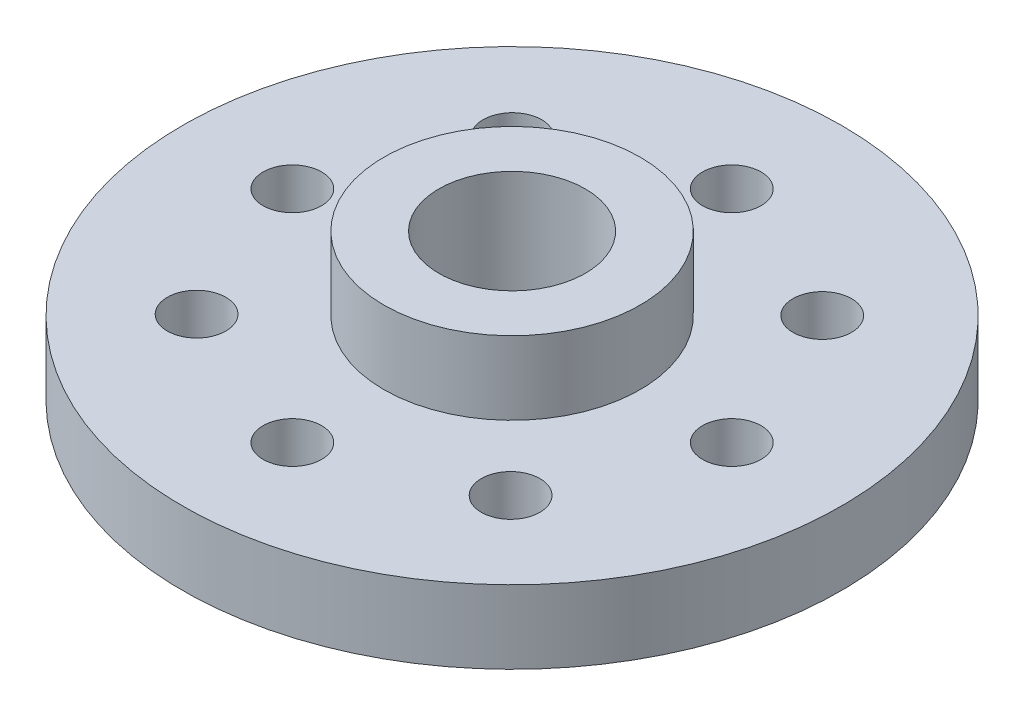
ISO-10303-21;
HEADER;
FILE_DESCRIPTION(('STEP AP214'),'2;1');
FILE_NAME('part.step','',(''),(''),'','','');
FILE_SCHEMA(('AUTOMOTIVE_DESIGN { 1 0 10303 214 1 1 1 1 }'));
ENDSEC;
DATA;
#1=APPLICATION_CONTEXT('core data for automotive mechanical design processes');
#2=APPLICATION_PROTOCOL_DEFINITION('international standard','automotive_design',2000,#1);
#3=PRODUCT_CONTEXT('',#1,'mechanical');
#4=PRODUCT('Part','Part','',(#3));
#5=PRODUCT_RELATED_PRODUCT_CATEGORY('part','',(#4));
#6=PRODUCT_DEFINITION_FORMATION('','',#4);
#7=PRODUCT_DEFINITION_CONTEXT('part definition',#1,'design');
#8=PRODUCT_DEFINITION('design','',#6,#7);
#9=PRODUCT_DEFINITION_SHAPE('','',#8);
#10=(LENGTH_UNIT() NAMED_UNIT(*) SI_UNIT(.MILLI.,.METRE.));
#11=(NAMED_UNIT(*) PLANE_ANGLE_UNIT() SI_UNIT($,.RADIAN.));
#12=(NAMED_UNIT(*) SI_UNIT($,.STERADIAN.) SOLID_ANGLE_UNIT());
#13=UNCERTAINTY_MEASURE_WITH_UNIT(LENGTH_MEASURE(1.E-05),#10,'distance_accuracy_value','');
#14=(GEOMETRIC_REPRESENTATION_CONTEXT(3) GLOBAL_UNCERTAINTY_ASSIGNED_CONTEXT((#13)) GLOBAL_UNIT_ASSIGNED_CONTEXT((#10,
#11,#12)) REPRESENTATION_CONTEXT('',''));
#15=CARTESIAN_POINT('',(0.,0.,0.));
#16=DIRECTION('',(0.,0.,1.));
#17=DIRECTION('',(1.,0.,0.));
#18=AXIS2_PLACEMENT_3D('',#15,#16,#17);
#19=CARTESIAN_POINT('',(0.,0.,0.));
#20=DIRECTION('',(0.,-1.,0.));
#21=DIRECTION('',(0.,0.,-1.));
#22=AXIS2_PLACEMENT_3D('',#19,#20,#21);
#23=CYLINDRICAL_SURFACE('',#22,1.);
#24=CARTESIAN_POINT('',(0.,0.5,0.));
#25=DIRECTION('',(0.,-1.,0.));
#26=DIRECTION('',(0.,0.,-1.));
#27=AXIS2_PLACEMENT_3D('',#24,#25,#26);
#28=CIRCLE('',#27,1.);
#29=CARTESIAN_POINT('',(0.,0.5,-1.));
#30=VERTEX_POINT('',#29);
#31=EDGE_CURVE('E198',#30,#30,#28,.T.);
#32=ORIENTED_EDGE('',*,*,#31,.F.);
#33=EDGE_LOOP('',(#32));
#34=FACE_BOUND('',#33,.T.);
#35=CARTESIAN_POINT('',(0.,0.,0.));
#36=DIRECTION('',(0.,-1.,0.));
#37=DIRECTION('',(0.,0.,-1.));
#38=AXIS2_PLACEMENT_3D('',#35,#36,#37);
#39=CIRCLE('',#38,1.);
#40=CARTESIAN_POINT('',(0.,0.,-1.));
#41=VERTEX_POINT('',#40);
#42=EDGE_CURVE('E11',#41,#41,#39,.T.);
#43=ORIENTED_EDGE('',*,*,#42,.T.);
#44=EDGE_LOOP('',(#43));
#45=FACE_BOUND('',#44,.T.);
#46=ADVANCED_FACE('F108',(#34,#45),#23,.F.);
#47=CARTESIAN_POINT('',(-1.,0.,0.));
#48=DIRECTION('',(0.,1.,0.));
#49=DIRECTION('',(0.,0.,1.));
#50=AXIS2_PLACEMENT_3D('',#47,#48,#49);
#51=PLANE('',#50);
#52=CARTESIAN_POINT('',(0.,0.,6.));
#53=DIRECTION('',(0.,-1.,0.));
#54=DIRECTION('',(0.,0.,-1.));
#55=AXIS2_PLACEMENT_3D('',#52,#53,#54);
#56=CIRCLE('',#55,0.799999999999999);
#57=CARTESIAN_POINT('',(0.,0.,5.2));
#58=VERTEX_POINT('',#57);
#59=EDGE_CURVE('E175',#58,#58,#56,.T.);
#60=ORIENTED_EDGE('',*,*,#59,.F.);
#61=EDGE_LOOP('',(#60));
#62=FACE_BOUND('',#61,.T.);
#63=CARTESIAN_POINT('',(-6.,0.,0.));
#64=DIRECTION('',(0.,-1.,0.));
#65=DIRECTION('',(0.,0.,-1.));
#66=AXIS2_PLACEMENT_3D('',#63,#64,#65);
#67=CIRCLE('',#66,0.799999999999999);
#68=CARTESIAN_POINT('',(-6.,0.,-0.799999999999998));
#69=VERTEX_POINT('',#68);
#70=EDGE_CURVE('E152',#69,#69,#67,.T.);
#71=ORIENTED_EDGE('',*,*,#70,.F.);
#72=EDGE_LOOP('',(#71));
#73=FACE_BOUND('',#72,.T.);
#74=CARTESIAN_POINT('',(6.,0.,0.));
#75=DIRECTION('',(0.,-1.,0.));
#76=DIRECTION('',(0.,0.,-1.));
#77=AXIS2_PLACEMENT_3D('',#74,#75,#76);
#78=CIRCLE('',#77,0.799999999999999);
#79=CARTESIAN_POINT('',(6.,0.,-0.799999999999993));
#80=VERTEX_POINT('',#79);
#81=EDGE_CURVE('E147',#80,#80,#78,.T.);
#82=ORIENTED_EDGE('',*,*,#81,.F.);
#83=EDGE_LOOP('',(#82));
#84=FACE_BOUND('',#83,.T.);
#85=CARTESIAN_POINT('',(0.,0.,-6.));
#86=DIRECTION('',(0.,-1.,0.));
#87=DIRECTION('',(0.,0.,-1.));
#88=AXIS2_PLACEMENT_3D('',#85,#86,#87);
#89=CIRCLE('',#88,0.799999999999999);
#90=CARTESIAN_POINT('',(0.,0.,-6.8));
#91=VERTEX_POINT('',#90);
#92=EDGE_CURVE('E149',#91,#91,#89,.T.);
#93=ORIENTED_EDGE('',*,*,#92,.F.);
#94=EDGE_LOOP('',(#93));
#95=FACE_BOUND('',#94,.T.);
#96=CARTESIAN_POINT('',(4.2312327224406,0.,-4.23927689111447));
#97=DIRECTION('',(0.,-1.,0.));
#98=DIRECTION('',(0.,0.,-1.));
#99=AXIS2_PLACEMENT_3D('',#96,#97,#98);
#100=CIRCLE('',#99,0.799999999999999);
#101=CARTESIAN_POINT('',(4.2312327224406,0.,-5.03927689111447));
#102=VERTEX_POINT('',#101);
#103=EDGE_CURVE('E144',#102,#102,#100,.T.);
#104=ORIENTED_EDGE('',*,*,#103,.F.);
#105=EDGE_LOOP('',(#104));
#106=FACE_BOUND('',#105,.T.);
#107=CARTESIAN_POINT('',(4.2312327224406,0.,4.27145356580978));
#108=DIRECTION('',(0.,-1.,0.));
#109=DIRECTION('',(0.,0.,-1.));
#110=AXIS2_PLACEMENT_3D('',#107,#108,#109);
#111=CIRCLE('',#110,0.799999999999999);
#112=CARTESIAN_POINT('',(4.2312327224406,0.,3.47145356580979));
#113=VERTEX_POINT('',#112);
#114=EDGE_CURVE('E139',#113,#113,#111,.T.);
#115=ORIENTED_EDGE('',*,*,#114,.F.);
#116=EDGE_LOOP('',(#115));
#117=FACE_BOUND('',#116,.T.);
#118=CARTESIAN_POINT('',(-4.34385108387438,0.,4.27145356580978));
#119=DIRECTION('',(0.,-1.,0.));
#120=DIRECTION('',(0.,0.,-1.));
#121=AXIS2_PLACEMENT_3D('',#118,#119,#120);
#122=CIRCLE('',#121,0.799999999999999);
#123=CARTESIAN_POINT('',(-4.34385108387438,0.,3.47145356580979));
#124=VERTEX_POINT('',#123);
#125=EDGE_CURVE('E132',#124,#124,#122,.T.);
#126=ORIENTED_EDGE('',*,*,#125,.F.);
#127=EDGE_LOOP('',(#126));
#128=FACE_BOUND('',#127,.T.);
#129=CARTESIAN_POINT('',(-4.2312327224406,0.,-4.23927689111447));
#130=DIRECTION('',(0.,-1.,0.));
#131=DIRECTION('',(0.,0.,-1.));
#132=AXIS2_PLACEMENT_3D('',#129,#130,#131);
#133=CIRCLE('',#132,0.799999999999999);
#134=CARTESIAN_POINT('',(-4.2312327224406,0.,-5.03927689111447));
#135=VERTEX_POINT('',#134);
#136=EDGE_CURVE('E133',#135,#135,#133,.T.);
#137=ORIENTED_EDGE('',*,*,#136,.F.);
#138=EDGE_LOOP('',(#137));
#139=FACE_BOUND('',#138,.T.);
#140=ORIENTED_EDGE('',*,*,#42,.F.);
#141=EDGE_LOOP('',(#140));
#142=FACE_BOUND('',#141,.T.);
#143=CARTESIAN_POINT('',(0.,0.,0.));
#144=DIRECTION('',(0.,-1.,0.));
#145=DIRECTION('',(0.,0.,-1.));
#146=AXIS2_PLACEMENT_3D('',#143,#144,#145);
#147=CIRCLE('',#146,9.);
#148=CARTESIAN_POINT('',(0.,0.,-9.));
#149=VERTEX_POINT('',#148);
#150=EDGE_CURVE('E116',#149,#149,#147,.T.);
#151=ORIENTED_EDGE('',*,*,#150,.T.);
#152=EDGE_LOOP('',(#151));
#153=FACE_BOUND('',#152,.T.);
#154=ADVANCED_FACE('F251',(#62,#73,#84,#95,#106,#117,#128,#139,#142,#153),#51,.F.);
#155=CARTESIAN_POINT('',(0.,0.,0.));
#156=DIRECTION('',(0.,-1.,0.));
#157=DIRECTION('',(0.,0.,-1.));
#158=AXIS2_PLACEMENT_3D('',#155,#156,#157);
#159=CYLINDRICAL_SURFACE('',#158,9.);
#160=ORIENTED_EDGE('',*,*,#150,.F.);
#161=EDGE_LOOP('',(#160));
#162=FACE_BOUND('',#161,.T.);
#163=CARTESIAN_POINT('',(0.,2.,0.));
#164=DIRECTION('',(0.,-1.,0.));
#165=DIRECTION('',(0.,0.,-1.));
#166=AXIS2_PLACEMENT_3D('',#163,#164,#165);
#167=CIRCLE('',#166,9.);
#168=CARTESIAN_POINT('',(0.,2.,-9.));
#169=VERTEX_POINT('',#168);
#170=EDGE_CURVE('E127',#169,#169,#167,.T.);
#171=ORIENTED_EDGE('',*,*,#170,.T.);
#172=EDGE_LOOP('',(#171));
#173=FACE_BOUND('',#172,.T.);
#174=ADVANCED_FACE('F218',(#162,#173),#159,.T.);
#175=CARTESIAN_POINT('',(-9.,2.,0.));
#176=DIRECTION('',(0.,-1.,0.));
#177=DIRECTION('',(0.,0.,-1.));
#178=AXIS2_PLACEMENT_3D('',#175,#176,#177);
#179=PLANE('',#178);
#180=CARTESIAN_POINT('',(0.,2.,6.));
#181=DIRECTION('',(0.,-1.,0.));
#182=DIRECTION('',(0.,0.,-1.));
#183=AXIS2_PLACEMENT_3D('',#180,#181,#182);
#184=CIRCLE('',#183,0.799999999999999);
#185=CARTESIAN_POINT('',(0.,2.,5.2));
#186=VERTEX_POINT('',#185);
#187=EDGE_CURVE('E115',#186,#186,#184,.T.);
#188=ORIENTED_EDGE('',*,*,#187,.T.);
#189=EDGE_LOOP('',(#188));
#190=FACE_BOUND('',#189,.T.);
#191=CARTESIAN_POINT('',(-6.,2.,0.));
#192=DIRECTION('',(0.,-1.,0.));
#193=DIRECTION('',(0.,0.,-1.));
#194=AXIS2_PLACEMENT_3D('',#191,#192,#193);
#195=CIRCLE('',#194,0.799999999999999);
#196=CARTESIAN_POINT('',(-6.,2.,-0.799999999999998));
#197=VERTEX_POINT('',#196);
#198=EDGE_CURVE('E151',#197,#197,#195,.T.);
#199=ORIENTED_EDGE('',*,*,#198,.T.);
#200=EDGE_LOOP('',(#199));
#201=FACE_BOUND('',#200,.T.);
#202=CARTESIAN_POINT('',(6.,2.,0.));
#203=DIRECTION('',(0.,-1.,0.));
#204=DIRECTION('',(0.,0.,-1.));
#205=AXIS2_PLACEMENT_3D('',#202,#203,#204);
#206=CIRCLE('',#205,0.799999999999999);
#207=CARTESIAN_POINT('',(6.,2.,-0.799999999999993));
#208=VERTEX_POINT('',#207);
#209=EDGE_CURVE('E148',#208,#208,#206,.T.);
#210=ORIENTED_EDGE('',*,*,#209,.T.);
#211=EDGE_LOOP('',(#210));
#212=FACE_BOUND('',#211,.T.);
#213=CARTESIAN_POINT('',(0.,2.,-6.));
#214=DIRECTION('',(0.,-1.,0.));
#215=DIRECTION('',(0.,0.,-1.));
#216=AXIS2_PLACEMENT_3D('',#213,#214,#215);
#217=CIRCLE('',#216,0.799999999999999);
#218=CARTESIAN_POINT('',(0.,2.,-6.8));
#219=VERTEX_POINT('',#218);
#220=EDGE_CURVE('E179',#219,#219,#217,.T.);
#221=ORIENTED_EDGE('',*,*,#220,.T.);
#222=EDGE_LOOP('',(#221));
#223=FACE_BOUND('',#222,.T.);
#224=CARTESIAN_POINT('',(4.2312327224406,2.,-4.23927689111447));
#225=DIRECTION('',(0.,-1.,0.));
#226=DIRECTION('',(0.,0.,-1.));
#227=AXIS2_PLACEMENT_3D('',#224,#225,#226);
#228=CIRCLE('',#227,0.799999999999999);
#229=CARTESIAN_POINT('',(4.2312327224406,2.,-5.03927689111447));
#230=VERTEX_POINT('',#229);
#231=EDGE_CURVE('E143',#230,#230,#228,.T.);
#232=ORIENTED_EDGE('',*,*,#231,.T.);
#233=EDGE_LOOP('',(#232));
#234=FACE_BOUND('',#233,.T.);
#235=CARTESIAN_POINT('',(4.2312327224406,2.,4.27145356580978));
#236=DIRECTION('',(0.,-1.,0.));
#237=DIRECTION('',(0.,0.,-1.));
#238=AXIS2_PLACEMENT_3D('',#235,#236,#237);
#239=CIRCLE('',#238,0.799999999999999);
#240=CARTESIAN_POINT('',(4.2312327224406,2.,3.47145356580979));
#241=VERTEX_POINT('',#240);
#242=EDGE_CURVE('E136',#241,#241,#239,.T.);
#243=ORIENTED_EDGE('',*,*,#242,.T.);
#244=EDGE_LOOP('',(#243));
#245=FACE_BOUND('',#244,.T.);
#246=CARTESIAN_POINT('',(-4.34385108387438,2.,4.27145356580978));
#247=DIRECTION('',(0.,-1.,0.));
#248=DIRECTION('',(0.,0.,-1.));
#249=AXIS2_PLACEMENT_3D('',#246,#247,#248);
#250=CIRCLE('',#249,0.799999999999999);
#251=CARTESIAN_POINT('',(-4.34385108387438,2.,3.47145356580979));
#252=VERTEX_POINT('',#251);
#253=EDGE_CURVE('E128',#252,#252,#250,.T.);
#254=ORIENTED_EDGE('',*,*,#253,.T.);
#255=EDGE_LOOP('',(#254));
#256=FACE_BOUND('',#255,.T.);
#257=CARTESIAN_POINT('',(-4.2312327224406,2.,-4.23927689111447));
#258=DIRECTION('',(0.,-1.,0.));
#259=DIRECTION('',(0.,0.,-1.));
#260=AXIS2_PLACEMENT_3D('',#257,#258,#259);
#261=CIRCLE('',#260,0.799999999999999);
#262=CARTESIAN_POINT('',(-4.2312327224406,2.,-5.03927689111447));
#263=VERTEX_POINT('',#262);
#264=EDGE_CURVE('E195',#263,#263,#261,.T.);
#265=ORIENTED_EDGE('',*,*,#264,.T.);
#266=EDGE_LOOP('',(#265));
#267=FACE_BOUND('',#266,.T.);
#268=ORIENTED_EDGE('',*,*,#170,.F.);
#269=EDGE_LOOP('',(#268));
#270=FACE_BOUND('',#269,.T.);
#271=CARTESIAN_POINT('',(0.,2.,0.));
#272=DIRECTION('',(0.,-1.,0.));
#273=DIRECTION('',(0.,0.,-1.));
#274=AXIS2_PLACEMENT_3D('',#271,#272,#273);
#275=CIRCLE('',#274,3.5);
#276=CARTESIAN_POINT('',(0.,2.,-3.5));
#277=VERTEX_POINT('',#276);
#278=EDGE_CURVE('E209',#277,#277,#275,.T.);
#279=ORIENTED_EDGE('',*,*,#278,.T.);
#280=EDGE_LOOP('',(#279));
#281=FACE_BOUND('',#280,.T.);
#282=ADVANCED_FACE('F222',(#190,#201,#212,#223,#234,#245,#256,#267,#270,#281),#179,.F.);
#283=CARTESIAN_POINT('',(0.,0.,0.));
#284=DIRECTION('',(0.,-1.,0.));
#285=DIRECTION('',(0.,0.,-1.));
#286=AXIS2_PLACEMENT_3D('',#283,#284,#285);
#287=CYLINDRICAL_SURFACE('',#286,3.5);
#288=ORIENTED_EDGE('',*,*,#278,.F.);
#289=EDGE_LOOP('',(#288));
#290=FACE_BOUND('',#289,.T.);
#291=CARTESIAN_POINT('',(0.,4.,0.));
#292=DIRECTION('',(0.,-1.,0.));
#293=DIRECTION('',(0.,0.,-1.));
#294=AXIS2_PLACEMENT_3D('',#291,#292,#293);
#295=CIRCLE('',#294,3.5);
#296=CARTESIAN_POINT('',(0.,4.,-3.5));
#297=VERTEX_POINT('',#296);
#298=EDGE_CURVE('E206',#297,#297,#295,.T.);
#299=ORIENTED_EDGE('',*,*,#298,.T.);
#300=EDGE_LOOP('',(#299));
#301=FACE_BOUND('',#300,.T.);
#302=ADVANCED_FACE('F221',(#290,#301),#287,.T.);
#303=CARTESIAN_POINT('',(-3.5,4.,0.));
#304=DIRECTION('',(0.,-1.,0.));
#305=DIRECTION('',(0.,0.,-1.));
#306=AXIS2_PLACEMENT_3D('',#303,#304,#305);
#307=PLANE('',#306);
#308=ORIENTED_EDGE('',*,*,#298,.F.);
#309=EDGE_LOOP('',(#308));
#310=FACE_BOUND('',#309,.T.);
#311=CARTESIAN_POINT('',(0.,4.,0.));
#312=DIRECTION('',(0.,-1.,0.));
#313=DIRECTION('',(0.,0.,-1.));
#314=AXIS2_PLACEMENT_3D('',#311,#312,#313);
#315=CIRCLE('',#314,2.);
#316=CARTESIAN_POINT('',(0.,4.,-2.));
#317=VERTEX_POINT('',#316);
#318=EDGE_CURVE('E205',#317,#317,#315,.T.);
#319=ORIENTED_EDGE('',*,*,#318,.T.);
#320=EDGE_LOOP('',(#319));
#321=FACE_BOUND('',#320,.T.);
#322=ADVANCED_FACE('F231',(#310,#321),#307,.F.);
#323=CARTESIAN_POINT('',(0.,0.,0.));
#324=DIRECTION('',(0.,-1.,0.));
#325=DIRECTION('',(0.,0.,-1.));
#326=AXIS2_PLACEMENT_3D('',#323,#324,#325);
#327=CYLINDRICAL_SURFACE('',#326,2.);
#328=ORIENTED_EDGE('',*,*,#318,.F.);
#329=EDGE_LOOP('',(#328));
#330=FACE_BOUND('',#329,.T.);
#331=CARTESIAN_POINT('',(0.,0.5,0.));
#332=DIRECTION('',(0.,-1.,0.));
#333=DIRECTION('',(0.,0.,-1.));
#334=AXIS2_PLACEMENT_3D('',#331,#332,#333);
#335=CIRCLE('',#334,2.);
#336=CARTESIAN_POINT('',(0.,0.5,-2.));
#337=VERTEX_POINT('',#336);
#338=EDGE_CURVE('E200',#337,#337,#335,.T.);
#339=ORIENTED_EDGE('',*,*,#338,.T.);
#340=EDGE_LOOP('',(#339));
#341=FACE_BOUND('',#340,.T.);
#342=ADVANCED_FACE('F240',(#330,#341),#327,.F.);
#343=CARTESIAN_POINT('',(-2.,0.5,0.));
#344=DIRECTION('',(0.,-1.,0.));
#345=DIRECTION('',(0.,0.,-1.));
#346=AXIS2_PLACEMENT_3D('',#343,#344,#345);
#347=PLANE('',#346);
#348=ORIENTED_EDGE('',*,*,#338,.F.);
#349=EDGE_LOOP('',(#348));
#350=FACE_BOUND('',#349,.T.);
#351=ORIENTED_EDGE('',*,*,#31,.T.);
#352=EDGE_LOOP('',(#351));
#353=FACE_BOUND('',#352,.T.);
#354=ADVANCED_FACE('F241',(#350,#353),#347,.F.);
#355=CARTESIAN_POINT('',(-4.2312327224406,0.,-4.23927689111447));
#356=DIRECTION('',(0.,-1.,0.));
#357=DIRECTION('',(0.,0.,-1.));
#358=AXIS2_PLACEMENT_3D('',#355,#356,#357);
#359=CYLINDRICAL_SURFACE('',#358,0.799999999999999);
#360=ORIENTED_EDGE('',*,*,#136,.T.);
#361=EDGE_LOOP('',(#360));
#362=FACE_BOUND('',#361,.T.);
#363=ORIENTED_EDGE('',*,*,#264,.F.);
#364=EDGE_LOOP('',(#363));
#365=FACE_BOUND('',#364,.T.);
#366=ADVANCED_FACE('F247',(#362,#365),#359,.F.);
#367=CARTESIAN_POINT('',(-4.34385108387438,0.,4.27145356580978));
#368=DIRECTION('',(0.,-1.,0.));
#369=DIRECTION('',(0.,0.,-1.));
#370=AXIS2_PLACEMENT_3D('',#367,#368,#369);
#371=CYLINDRICAL_SURFACE('',#370,0.799999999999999);
#372=ORIENTED_EDGE('',*,*,#125,.T.);
#373=EDGE_LOOP('',(#372));
#374=FACE_BOUND('',#373,.T.);
#375=ORIENTED_EDGE('',*,*,#253,.F.);
#376=EDGE_LOOP('',(#375));
#377=FACE_BOUND('',#376,.T.);
#378=ADVANCED_FACE('F269',(#374,#377),#371,.F.);
#379=CARTESIAN_POINT('',(4.2312327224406,0.,4.27145356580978));
#380=DIRECTION('',(0.,-1.,0.));
#381=DIRECTION('',(0.,0.,-1.));
#382=AXIS2_PLACEMENT_3D('',#379,#380,#381);
#383=CYLINDRICAL_SURFACE('',#382,0.799999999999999);
#384=ORIENTED_EDGE('',*,*,#114,.T.);
#385=EDGE_LOOP('',(#384));
#386=FACE_BOUND('',#385,.T.);
#387=ORIENTED_EDGE('',*,*,#242,.F.);
#388=EDGE_LOOP('',(#387));
#389=FACE_BOUND('',#388,.T.);
#390=ADVANCED_FACE('F273',(#386,#389),#383,.F.);
#391=CARTESIAN_POINT('',(4.2312327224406,0.,-4.23927689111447));
#392=DIRECTION('',(0.,-1.,0.));
#393=DIRECTION('',(0.,0.,-1.));
#394=AXIS2_PLACEMENT_3D('',#391,#392,#393);
#395=CYLINDRICAL_SURFACE('',#394,0.799999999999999);
#396=ORIENTED_EDGE('',*,*,#103,.T.);
#397=EDGE_LOOP('',(#396));
#398=FACE_BOUND('',#397,.T.);
#399=ORIENTED_EDGE('',*,*,#231,.F.);
#400=EDGE_LOOP('',(#399));
#401=FACE_BOUND('',#400,.T.);
#402=ADVANCED_FACE('F279',(#398,#401),#395,.F.);
#403=CARTESIAN_POINT('',(0.,0.,-6.));
#404=DIRECTION('',(0.,-1.,0.));
#405=DIRECTION('',(0.,0.,-1.));
#406=AXIS2_PLACEMENT_3D('',#403,#404,#405);
#407=CYLINDRICAL_SURFACE('',#406,0.799999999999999);
#408=ORIENTED_EDGE('',*,*,#92,.T.);
#409=EDGE_LOOP('',(#408));
#410=FACE_BOUND('',#409,.T.);
#411=ORIENTED_EDGE('',*,*,#220,.F.);
#412=EDGE_LOOP('',(#411));
#413=FACE_BOUND('',#412,.T.);
#414=ADVANCED_FACE('F281',(#410,#413),#407,.F.);
#415=CARTESIAN_POINT('',(6.,0.,0.));
#416=DIRECTION('',(0.,-1.,0.));
#417=DIRECTION('',(0.,0.,-1.));
#418=AXIS2_PLACEMENT_3D('',#415,#416,#417);
#419=CYLINDRICAL_SURFACE('',#418,0.799999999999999);
#420=ORIENTED_EDGE('',*,*,#81,.T.);
#421=EDGE_LOOP('',(#420));
#422=FACE_BOUND('',#421,.T.);
#423=ORIENTED_EDGE('',*,*,#209,.F.);
#424=EDGE_LOOP('',(#423));
#425=FACE_BOUND('',#424,.T.);
#426=ADVANCED_FACE('F282',(#422,#425),#419,.F.);
#427=CARTESIAN_POINT('',(-6.,0.,0.));
#428=DIRECTION('',(0.,-1.,0.));
#429=DIRECTION('',(0.,0.,-1.));
#430=AXIS2_PLACEMENT_3D('',#427,#428,#429);
#431=CYLINDRICAL_SURFACE('',#430,0.799999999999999);
#432=ORIENTED_EDGE('',*,*,#70,.T.);
#433=EDGE_LOOP('',(#432));
#434=FACE_BOUND('',#433,.T.);
#435=ORIENTED_EDGE('',*,*,#198,.F.);
#436=EDGE_LOOP('',(#435));
#437=FACE_BOUND('',#436,.T.);
#438=ADVANCED_FACE('F289',(#434,#437),#431,.F.);
#439=CARTESIAN_POINT('',(0.,0.,6.));
#440=DIRECTION('',(0.,-1.,0.));
#441=DIRECTION('',(0.,0.,-1.));
#442=AXIS2_PLACEMENT_3D('',#439,#440,#441);
#443=CYLINDRICAL_SURFACE('',#442,0.799999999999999);
#444=ORIENTED_EDGE('',*,*,#59,.T.);
#445=EDGE_LOOP('',(#444));
#446=FACE_BOUND('',#445,.T.);
#447=ORIENTED_EDGE('',*,*,#187,.F.);
#448=EDGE_LOOP('',(#447));
#449=FACE_BOUND('',#448,.T.);
#450=ADVANCED_FACE('F295',(#446,#449),#443,.F.);
#451=CLOSED_SHELL('',(#46,#154,#174,#282,#302,#322,#342,#354,#366,#378,#390,#402,#414,#426,#438,#450));
#452=MANIFOLD_SOLID_BREP('B2',#451);
#453=ADVANCED_BREP_SHAPE_REPRESENTATION('',(#18,#452),#14);
#454=SHAPE_DEFINITION_REPRESENTATION(#9,#453);
ENDSEC;
END-ISO-10303-21;
